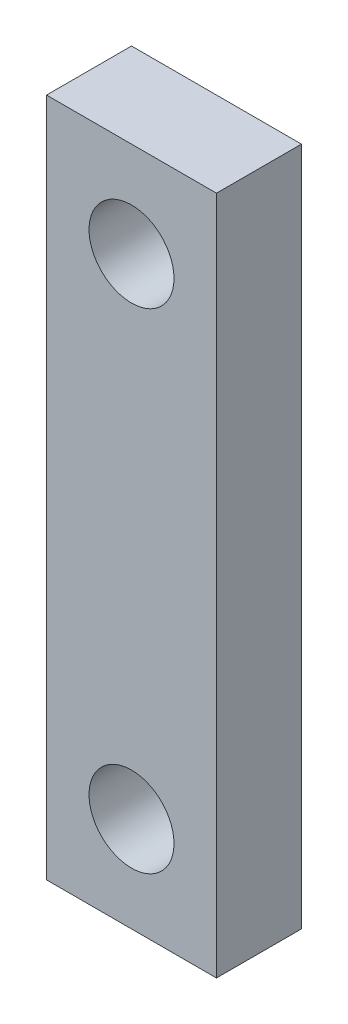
from build123d import *

# Parameters (mm, degrees)
SKETCH1_W          = 3.175
SKETCH1_H          = 12.7
LINK_DEPTH         = 1.5875
SKETCH2_R          = 0.79375
CUT_EXTRUDE1_DEPTH = 7.735192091


with BuildPart() as part:
    # Sketch1 → Link (new body)
    with BuildSketch(Plane.XY):
        Rectangle(SKETCH1_W, SKETCH1_H)
    extrude(amount=LINK_DEPTH)

    # Sketch2 → Cut-Extrude1 (cut, through all)
    with BuildSketch(Plane.XY.offset(1.5875)):
        with Locations((0, 4.572)):
            Circle(SKETCH2_R)
        with Locations((0, -4.572)):
            Circle(SKETCH2_R)
    extrude(amount=-CUT_EXTRUDE1_DEPTH, mode=Mode.SUBTRACT)


solid = part.part
